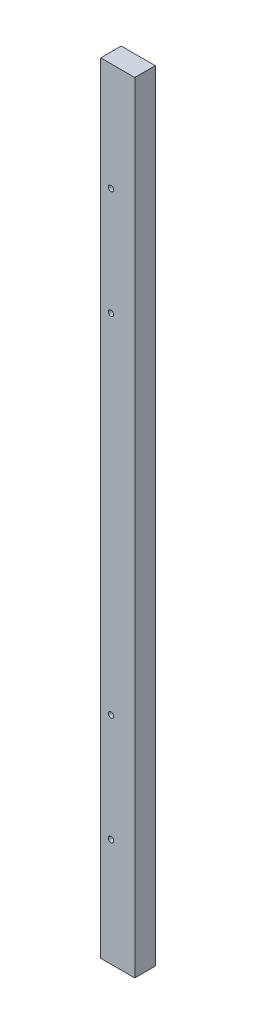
ISO-10303-21;
HEADER;
FILE_DESCRIPTION(('STEP AP214'),'2;1');
FILE_NAME('part.step','',(''),(''),'','','');
FILE_SCHEMA(('AUTOMOTIVE_DESIGN { 1 0 10303 214 1 1 1 1 }'));
ENDSEC;
DATA;
#1=APPLICATION_CONTEXT('core data for automotive mechanical design processes');
#2=APPLICATION_PROTOCOL_DEFINITION('international standard','automotive_design',2000,#1);
#3=PRODUCT_CONTEXT('',#1,'mechanical');
#4=PRODUCT('Part','Part','',(#3));
#5=PRODUCT_RELATED_PRODUCT_CATEGORY('part','',(#4));
#6=PRODUCT_DEFINITION_FORMATION('','',#4);
#7=PRODUCT_DEFINITION_CONTEXT('part definition',#1,'design');
#8=PRODUCT_DEFINITION('design','',#6,#7);
#9=PRODUCT_DEFINITION_SHAPE('','',#8);
#10=(LENGTH_UNIT() NAMED_UNIT(*) SI_UNIT(.MILLI.,.METRE.));
#11=(NAMED_UNIT(*) PLANE_ANGLE_UNIT() SI_UNIT($,.RADIAN.));
#12=(NAMED_UNIT(*) SI_UNIT($,.STERADIAN.) SOLID_ANGLE_UNIT());
#13=UNCERTAINTY_MEASURE_WITH_UNIT(LENGTH_MEASURE(1.E-05),#10,'distance_accuracy_value','');
#14=(GEOMETRIC_REPRESENTATION_CONTEXT(3) GLOBAL_UNCERTAINTY_ASSIGNED_CONTEXT((#13)) GLOBAL_UNIT_ASSIGNED_CONTEXT((#10,
#11,#12)) REPRESENTATION_CONTEXT('',''));
#15=CARTESIAN_POINT('',(0.,0.,0.));
#16=DIRECTION('',(0.,0.,1.));
#17=DIRECTION('',(1.,0.,0.));
#18=AXIS2_PLACEMENT_3D('',#15,#16,#17);
#19=CARTESIAN_POINT('',(0.,0.,38.));
#20=DIRECTION('',(1.,0.,0.));
#21=DIRECTION('',(0.,0.,-1.));
#22=AXIS2_PLACEMENT_3D('',#19,#20,#21);
#23=PLANE('',#22);
#24=DIRECTION('',(0.,-1.,0.));
#25=VECTOR('',#24,1.);
#26=CARTESIAN_POINT('',(0.,0.,0.));
#27=LINE('',#26,#25);
#28=CARTESIAN_POINT('',(0.,1444.,0.));
#29=VERTEX_POINT('',#28);
#30=CARTESIAN_POINT('',(0.,0.,0.));
#31=VERTEX_POINT('',#30);
#32=EDGE_CURVE('E99',#29,#31,#27,.T.);
#33=ORIENTED_EDGE('',*,*,#32,.T.);
#34=DIRECTION('',(0.,0.,-1.));
#35=VECTOR('',#34,1.);
#36=CARTESIAN_POINT('',(0.,0.,38.));
#37=LINE('',#36,#35);
#38=CARTESIAN_POINT('',(0.,0.,38.));
#39=VERTEX_POINT('',#38);
#40=EDGE_CURVE('E11',#39,#31,#37,.T.);
#41=ORIENTED_EDGE('',*,*,#40,.F.);
#42=DIRECTION('',(0.,-1.,0.));
#43=VECTOR('',#42,1.);
#44=CARTESIAN_POINT('',(0.,0.,38.));
#45=LINE('',#44,#43);
#46=CARTESIAN_POINT('',(0.,1444.,38.));
#47=VERTEX_POINT('',#46);
#48=EDGE_CURVE('E87',#47,#39,#45,.T.);
#49=ORIENTED_EDGE('',*,*,#48,.F.);
#50=DIRECTION('',(0.,0.,-1.));
#51=VECTOR('',#50,1.);
#52=CARTESIAN_POINT('',(0.,1444.,38.));
#53=LINE('',#52,#51);
#54=EDGE_CURVE('E95',#47,#29,#53,.T.);
#55=ORIENTED_EDGE('',*,*,#54,.T.);
#56=EDGE_LOOP('',(#33,#41,#49,#55));
#57=FACE_BOUND('',#56,.T.);
#58=ADVANCED_FACE('F36',(#57),#23,.F.);
#59=CARTESIAN_POINT('',(0.,0.,38.));
#60=DIRECTION('',(0.,1.,0.));
#61=DIRECTION('',(0.,0.,1.));
#62=AXIS2_PLACEMENT_3D('',#59,#60,#61);
#63=PLANE('',#62);
#64=DIRECTION('',(1.,0.,0.));
#65=VECTOR('',#64,1.);
#66=CARTESIAN_POINT('',(0.,0.,0.));
#67=LINE('',#66,#65);
#68=CARTESIAN_POINT('',(63.,0.,0.));
#69=VERTEX_POINT('',#68);
#70=EDGE_CURVE('E91',#31,#69,#67,.T.);
#71=ORIENTED_EDGE('',*,*,#70,.T.);
#72=DIRECTION('',(0.,0.,-1.));
#73=VECTOR('',#72,1.);
#74=CARTESIAN_POINT('',(63.,0.,38.));
#75=LINE('',#74,#73);
#76=CARTESIAN_POINT('',(63.,0.,38.));
#77=VERTEX_POINT('',#76);
#78=EDGE_CURVE('E44',#77,#69,#75,.T.);
#79=ORIENTED_EDGE('',*,*,#78,.F.);
#80=DIRECTION('',(1.,0.,0.));
#81=VECTOR('',#80,1.);
#82=CARTESIAN_POINT('',(0.,0.,38.));
#83=LINE('',#82,#81);
#84=EDGE_CURVE('E82',#39,#77,#83,.T.);
#85=ORIENTED_EDGE('',*,*,#84,.F.);
#86=ORIENTED_EDGE('',*,*,#40,.T.);
#87=EDGE_LOOP('',(#71,#79,#85,#86));
#88=FACE_BOUND('',#87,.T.);
#89=ADVANCED_FACE('F90',(#88),#63,.F.);
#90=CARTESIAN_POINT('',(63.,0.,38.));
#91=DIRECTION('',(-1.,0.,0.));
#92=DIRECTION('',(0.,0.,1.));
#93=AXIS2_PLACEMENT_3D('',#90,#91,#92);
#94=PLANE('',#93);
#95=DIRECTION('',(0.,1.,0.));
#96=VECTOR('',#95,1.);
#97=CARTESIAN_POINT('',(63.,0.,0.));
#98=LINE('',#97,#96);
#99=CARTESIAN_POINT('',(63.,1444.,0.));
#100=VERTEX_POINT('',#99);
#101=EDGE_CURVE('E69',#69,#100,#98,.T.);
#102=ORIENTED_EDGE('',*,*,#101,.T.);
#103=DIRECTION('',(0.,0.,-1.));
#104=VECTOR('',#103,1.);
#105=CARTESIAN_POINT('',(63.,1444.,38.));
#106=LINE('',#105,#104);
#107=CARTESIAN_POINT('',(63.,1444.,38.));
#108=VERTEX_POINT('',#107);
#109=EDGE_CURVE('E92',#108,#100,#106,.T.);
#110=ORIENTED_EDGE('',*,*,#109,.F.);
#111=DIRECTION('',(0.,1.,0.));
#112=VECTOR('',#111,1.);
#113=CARTESIAN_POINT('',(63.,0.,38.));
#114=LINE('',#113,#112);
#115=EDGE_CURVE('E85',#77,#108,#114,.T.);
#116=ORIENTED_EDGE('',*,*,#115,.F.);
#117=ORIENTED_EDGE('',*,*,#78,.T.);
#118=EDGE_LOOP('',(#102,#110,#116,#117));
#119=FACE_BOUND('',#118,.T.);
#120=ADVANCED_FACE('F93',(#119),#94,.F.);
#121=CARTESIAN_POINT('',(0.,1444.,38.));
#122=DIRECTION('',(0.,-1.,0.));
#123=DIRECTION('',(0.,0.,-1.));
#124=AXIS2_PLACEMENT_3D('',#121,#122,#123);
#125=PLANE('',#124);
#126=DIRECTION('',(-1.,0.,0.));
#127=VECTOR('',#126,1.);
#128=CARTESIAN_POINT('',(0.,1444.,0.));
#129=LINE('',#128,#127);
#130=EDGE_CURVE('E75',#100,#29,#129,.T.);
#131=ORIENTED_EDGE('',*,*,#130,.T.);
#132=ORIENTED_EDGE('',*,*,#54,.F.);
#133=DIRECTION('',(-1.,0.,0.));
#134=VECTOR('',#133,1.);
#135=CARTESIAN_POINT('',(0.,1444.,38.));
#136=LINE('',#135,#134);
#137=EDGE_CURVE('E52',#108,#47,#136,.T.);
#138=ORIENTED_EDGE('',*,*,#137,.F.);
#139=ORIENTED_EDGE('',*,*,#109,.T.);
#140=EDGE_LOOP('',(#131,#132,#138,#139));
#141=FACE_BOUND('',#140,.T.);
#142=ADVANCED_FACE('F107',(#141),#125,.F.);
#143=CARTESIAN_POINT('',(0.,0.,38.));
#144=DIRECTION('',(0.,0.,-1.));
#145=DIRECTION('',(-1.,0.,0.));
#146=AXIS2_PLACEMENT_3D('',#143,#144,#145);
#147=PLANE('',#146);
#148=CARTESIAN_POINT('',(19.0000000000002,200.,38.));
#149=DIRECTION('',(0.,0.,1.));
#150=DIRECTION('',(1.,0.,0.));
#151=AXIS2_PLACEMENT_3D('',#148,#149,#150);
#152=CIRCLE('',#151,5.);
#153=CARTESIAN_POINT('',(24.0000000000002,200.,38.));
#154=VERTEX_POINT('',#153);
#155=EDGE_CURVE('E102',#154,#154,#152,.T.);
#156=ORIENTED_EDGE('',*,*,#155,.F.);
#157=EDGE_LOOP('',(#156));
#158=FACE_BOUND('',#157,.T.);
#159=CARTESIAN_POINT('',(19.0000000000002,400.,38.));
#160=DIRECTION('',(0.,0.,1.));
#161=DIRECTION('',(1.,0.,0.));
#162=AXIS2_PLACEMENT_3D('',#159,#160,#161);
#163=CIRCLE('',#162,5.);
#164=CARTESIAN_POINT('',(24.0000000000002,400.,38.));
#165=VERTEX_POINT('',#164);
#166=EDGE_CURVE('E128',#165,#165,#163,.T.);
#167=ORIENTED_EDGE('',*,*,#166,.F.);
#168=EDGE_LOOP('',(#167));
#169=FACE_BOUND('',#168,.T.);
#170=CARTESIAN_POINT('',(19.0000000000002,1044.,38.));
#171=DIRECTION('',(0.,0.,1.));
#172=DIRECTION('',(-1.,0.,0.));
#173=AXIS2_PLACEMENT_3D('',#170,#171,#172);
#174=CIRCLE('',#173,5.00000000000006);
#175=CARTESIAN_POINT('',(14.0000000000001,1044.,38.));
#176=VERTEX_POINT('',#175);
#177=EDGE_CURVE('E122',#176,#176,#174,.T.);
#178=ORIENTED_EDGE('',*,*,#177,.F.);
#179=EDGE_LOOP('',(#178));
#180=FACE_BOUND('',#179,.T.);
#181=CARTESIAN_POINT('',(19.0000000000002,1244.,38.));
#182=DIRECTION('',(0.,0.,1.));
#183=DIRECTION('',(-1.,0.,0.));
#184=AXIS2_PLACEMENT_3D('',#181,#182,#183);
#185=CIRCLE('',#184,5.);
#186=CARTESIAN_POINT('',(14.0000000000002,1244.,38.));
#187=VERTEX_POINT('',#186);
#188=EDGE_CURVE('E116',#187,#187,#185,.T.);
#189=ORIENTED_EDGE('',*,*,#188,.F.);
#190=EDGE_LOOP('',(#189));
#191=FACE_BOUND('',#190,.T.);
#192=ORIENTED_EDGE('',*,*,#48,.T.);
#193=ORIENTED_EDGE('',*,*,#84,.T.);
#194=ORIENTED_EDGE('',*,*,#115,.T.);
#195=ORIENTED_EDGE('',*,*,#137,.T.);
#196=EDGE_LOOP('',(#192,#193,#194,#195));
#197=FACE_BOUND('',#196,.T.);
#198=ADVANCED_FACE('F83',(#158,#169,#180,#191,#197),#147,.F.);
#199=CARTESIAN_POINT('',(0.,0.,0.));
#200=DIRECTION('',(0.,0.,-1.));
#201=DIRECTION('',(-1.,0.,0.));
#202=AXIS2_PLACEMENT_3D('',#199,#200,#201);
#203=PLANE('',#202);
#204=CARTESIAN_POINT('',(19.0000000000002,200.,0.));
#205=DIRECTION('',(0.,0.,-1.));
#206=DIRECTION('',(-1.,0.,0.));
#207=AXIS2_PLACEMENT_3D('',#204,#205,#206);
#208=CIRCLE('',#207,5.);
#209=CARTESIAN_POINT('',(14.0000000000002,200.,0.));
#210=VERTEX_POINT('',#209);
#211=EDGE_CURVE('E131',#210,#210,#208,.F.);
#212=ORIENTED_EDGE('',*,*,#211,.T.);
#213=EDGE_LOOP('',(#212));
#214=FACE_BOUND('',#213,.T.);
#215=CARTESIAN_POINT('',(19.0000000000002,400.,0.));
#216=DIRECTION('',(0.,0.,-1.));
#217=DIRECTION('',(-1.,0.,0.));
#218=AXIS2_PLACEMENT_3D('',#215,#216,#217);
#219=CIRCLE('',#218,5.);
#220=CARTESIAN_POINT('',(14.0000000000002,400.,0.));
#221=VERTEX_POINT('',#220);
#222=EDGE_CURVE('E125',#221,#221,#219,.F.);
#223=ORIENTED_EDGE('',*,*,#222,.T.);
#224=EDGE_LOOP('',(#223));
#225=FACE_BOUND('',#224,.T.);
#226=CARTESIAN_POINT('',(19.0000000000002,1044.,0.));
#227=DIRECTION('',(0.,0.,-1.));
#228=DIRECTION('',(-1.,0.,0.));
#229=AXIS2_PLACEMENT_3D('',#226,#227,#228);
#230=CIRCLE('',#229,5.00000000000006);
#231=CARTESIAN_POINT('',(14.0000000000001,1044.,0.));
#232=VERTEX_POINT('',#231);
#233=EDGE_CURVE('E119',#232,#232,#230,.F.);
#234=ORIENTED_EDGE('',*,*,#233,.T.);
#235=EDGE_LOOP('',(#234));
#236=FACE_BOUND('',#235,.T.);
#237=CARTESIAN_POINT('',(19.0000000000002,1244.,0.));
#238=DIRECTION('',(0.,0.,-1.));
#239=DIRECTION('',(-1.,0.,0.));
#240=AXIS2_PLACEMENT_3D('',#237,#238,#239);
#241=CIRCLE('',#240,5.);
#242=CARTESIAN_POINT('',(14.0000000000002,1244.,0.));
#243=VERTEX_POINT('',#242);
#244=EDGE_CURVE('E113',#243,#243,#241,.F.);
#245=ORIENTED_EDGE('',*,*,#244,.T.);
#246=EDGE_LOOP('',(#245));
#247=FACE_BOUND('',#246,.T.);
#248=ORIENTED_EDGE('',*,*,#32,.F.);
#249=ORIENTED_EDGE('',*,*,#130,.F.);
#250=ORIENTED_EDGE('',*,*,#101,.F.);
#251=ORIENTED_EDGE('',*,*,#70,.F.);
#252=EDGE_LOOP('',(#248,#249,#250,#251));
#253=FACE_BOUND('',#252,.T.);
#254=ADVANCED_FACE('F110',(#214,#225,#236,#247,#253),#203,.T.);
#255=CARTESIAN_POINT('',(19.0000000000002,1244.,-0.001000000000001));
#256=DIRECTION('',(0.,0.,1.));
#257=DIRECTION('',(1.,0.,0.));
#258=AXIS2_PLACEMENT_3D('',#255,#256,#257);
#259=CYLINDRICAL_SURFACE('',#258,5.);
#260=ORIENTED_EDGE('',*,*,#244,.F.);
#261=EDGE_LOOP('',(#260));
#262=FACE_BOUND('',#261,.T.);
#263=ORIENTED_EDGE('',*,*,#188,.T.);
#264=EDGE_LOOP('',(#263));
#265=FACE_BOUND('',#264,.T.);
#266=ADVANCED_FACE('F148',(#262,#265),#259,.F.);
#267=CARTESIAN_POINT('',(19.0000000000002,1044.,-0.001000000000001));
#268=DIRECTION('',(0.,0.,1.));
#269=DIRECTION('',(1.,0.,0.));
#270=AXIS2_PLACEMENT_3D('',#267,#268,#269);
#271=CYLINDRICAL_SURFACE('',#270,5.00000000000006);
#272=ORIENTED_EDGE('',*,*,#233,.F.);
#273=EDGE_LOOP('',(#272));
#274=FACE_BOUND('',#273,.T.);
#275=ORIENTED_EDGE('',*,*,#177,.T.);
#276=EDGE_LOOP('',(#275));
#277=FACE_BOUND('',#276,.T.);
#278=ADVANCED_FACE('F150',(#274,#277),#271,.F.);
#279=CARTESIAN_POINT('',(19.0000000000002,400.,-0.001000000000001));
#280=DIRECTION('',(0.,0.,1.));
#281=DIRECTION('',(1.,0.,0.));
#282=AXIS2_PLACEMENT_3D('',#279,#280,#281);
#283=CYLINDRICAL_SURFACE('',#282,5.);
#284=ORIENTED_EDGE('',*,*,#222,.F.);
#285=EDGE_LOOP('',(#284));
#286=FACE_BOUND('',#285,.T.);
#287=ORIENTED_EDGE('',*,*,#166,.T.);
#288=EDGE_LOOP('',(#287));
#289=FACE_BOUND('',#288,.T.);
#290=ADVANCED_FACE('F157',(#286,#289),#283,.F.);
#291=CARTESIAN_POINT('',(19.0000000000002,200.,-0.001000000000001));
#292=DIRECTION('',(0.,0.,1.));
#293=DIRECTION('',(1.,0.,0.));
#294=AXIS2_PLACEMENT_3D('',#291,#292,#293);
#295=CYLINDRICAL_SURFACE('',#294,5.);
#296=ORIENTED_EDGE('',*,*,#211,.F.);
#297=EDGE_LOOP('',(#296));
#298=FACE_BOUND('',#297,.T.);
#299=ORIENTED_EDGE('',*,*,#155,.T.);
#300=EDGE_LOOP('',(#299));
#301=FACE_BOUND('',#300,.T.);
#302=ADVANCED_FACE('F137',(#298,#301),#295,.F.);
#303=CLOSED_SHELL('',(#58,#89,#120,#142,#198,#254,#266,#278,#290,#302));
#304=MANIFOLD_SOLID_BREP('B2',#303);
#305=ADVANCED_BREP_SHAPE_REPRESENTATION('',(#18,#304),#14);
#306=SHAPE_DEFINITION_REPRESENTATION(#9,#305);
ENDSEC;
END-ISO-10303-21;
